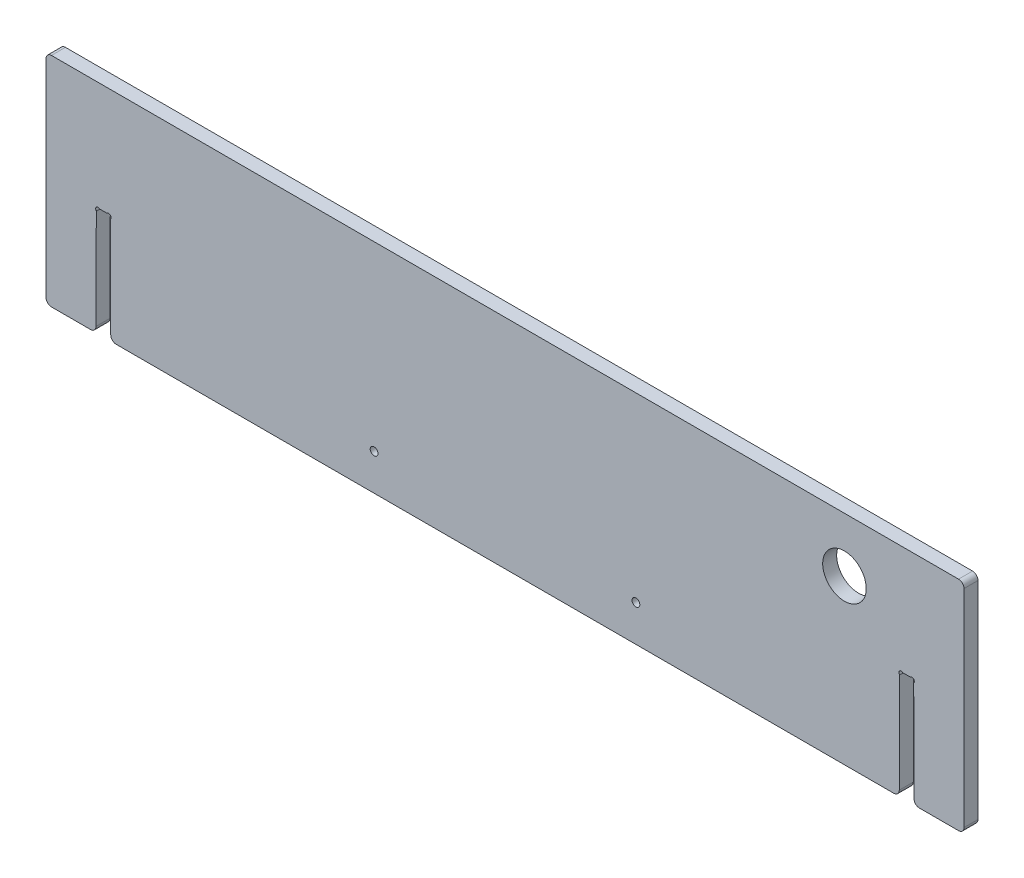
ISO-10303-21;
HEADER;
FILE_DESCRIPTION(('STEP AP214'),'2;1');
FILE_NAME('part.step','',(''),(''),'','','');
FILE_SCHEMA(('AUTOMOTIVE_DESIGN { 1 0 10303 214 1 1 1 1 }'));
ENDSEC;
DATA;
#1=APPLICATION_CONTEXT('core data for automotive mechanical design processes');
#2=APPLICATION_PROTOCOL_DEFINITION('international standard','automotive_design',2000,#1);
#3=PRODUCT_CONTEXT('',#1,'mechanical');
#4=PRODUCT('Part','Part','',(#3));
#5=PRODUCT_RELATED_PRODUCT_CATEGORY('part','',(#4));
#6=PRODUCT_DEFINITION_FORMATION('','',#4);
#7=PRODUCT_DEFINITION_CONTEXT('part definition',#1,'design');
#8=PRODUCT_DEFINITION('design','',#6,#7);
#9=PRODUCT_DEFINITION_SHAPE('','',#8);
#10=(LENGTH_UNIT() NAMED_UNIT(*) SI_UNIT(.MILLI.,.METRE.));
#11=(NAMED_UNIT(*) PLANE_ANGLE_UNIT() SI_UNIT($,.RADIAN.));
#12=(NAMED_UNIT(*) SI_UNIT($,.STERADIAN.) SOLID_ANGLE_UNIT());
#13=UNCERTAINTY_MEASURE_WITH_UNIT(LENGTH_MEASURE(1.E-05),#10,'distance_accuracy_value','');
#14=(GEOMETRIC_REPRESENTATION_CONTEXT(3) GLOBAL_UNCERTAINTY_ASSIGNED_CONTEXT((#13)) GLOBAL_UNIT_ASSIGNED_CONTEXT((#10,
#11,#12)) REPRESENTATION_CONTEXT('',''));
#15=CARTESIAN_POINT('',(0.,0.,0.));
#16=DIRECTION('',(0.,0.,1.));
#17=DIRECTION('',(1.,0.,0.));
#18=AXIS2_PLACEMENT_3D('',#15,#16,#17);
#19=CARTESIAN_POINT('',(0.,0.,18.));
#20=DIRECTION('',(0.,1.,0.));
#21=DIRECTION('',(0.,0.,1.));
#22=AXIS2_PLACEMENT_3D('',#19,#20,#21);
#23=PLANE('',#22);
#24=DIRECTION('',(1.,0.,0.));
#25=VECTOR('',#24,1.);
#26=CARTESIAN_POINT('',(0.,0.,0.));
#27=LINE('',#26,#25);
#28=CARTESIAN_POINT('',(7.,0.,0.));
#29=VERTEX_POINT('',#28);
#30=CARTESIAN_POINT('',(57.3324536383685,0.,0.));
#31=VERTEX_POINT('',#30);
#32=EDGE_CURVE('E466',#29,#31,#27,.T.);
#33=ORIENTED_EDGE('',*,*,#32,.T.);
#34=DIRECTION('',(0.,0.,1.));
#35=VECTOR('',#34,1.);
#36=CARTESIAN_POINT('',(57.3324536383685,0.,18.));
#37=LINE('',#36,#35);
#38=CARTESIAN_POINT('',(57.3324536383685,0.,18.));
#39=VERTEX_POINT('',#38);
#40=EDGE_CURVE('E491',#31,#39,#37,.T.);
#41=ORIENTED_EDGE('',*,*,#40,.T.);
#42=DIRECTION('',(1.,0.,0.));
#43=VECTOR('',#42,1.);
#44=CARTESIAN_POINT('',(0.,0.,18.));
#45=LINE('',#44,#43);
#46=CARTESIAN_POINT('',(7.,0.,18.));
#47=VERTEX_POINT('',#46);
#48=EDGE_CURVE('E459',#47,#39,#45,.T.);
#49=ORIENTED_EDGE('',*,*,#48,.F.);
#50=DIRECTION('',(0.,0.,-1.));
#51=VECTOR('',#50,1.);
#52=CARTESIAN_POINT('',(7.,0.,18.));
#53=LINE('',#52,#51);
#54=EDGE_CURVE('E488',#47,#29,#53,.T.);
#55=ORIENTED_EDGE('',*,*,#54,.T.);
#56=EDGE_LOOP('',(#33,#41,#49,#55));
#57=FACE_BOUND('',#56,.T.);
#58=ADVANCED_FACE('F33',(#57),#23,.F.);
#59=CARTESIAN_POINT('',(0.,0.,18.));
#60=DIRECTION('',(1.,0.,0.));
#61=DIRECTION('',(0.,0.,-1.));
#62=AXIS2_PLACEMENT_3D('',#59,#60,#61);
#63=PLANE('',#62);
#64=DIRECTION('',(0.,-1.,0.));
#65=VECTOR('',#64,1.);
#66=CARTESIAN_POINT('',(0.,0.,0.));
#67=LINE('',#66,#65);
#68=CARTESIAN_POINT('',(0.,273.25,0.));
#69=VERTEX_POINT('',#68);
#70=CARTESIAN_POINT('',(0.,7.,0.));
#71=VERTEX_POINT('',#70);
#72=EDGE_CURVE('E438',#69,#71,#67,.T.);
#73=ORIENTED_EDGE('',*,*,#72,.T.);
#74=DIRECTION('',(0.,0.,-1.));
#75=VECTOR('',#74,1.);
#76=CARTESIAN_POINT('',(0.,7.,18.));
#77=LINE('',#76,#75);
#78=CARTESIAN_POINT('',(0.,7.,18.));
#79=VERTEX_POINT('',#78);
#80=EDGE_CURVE('E41',#71,#79,#77,.F.);
#81=ORIENTED_EDGE('',*,*,#80,.T.);
#82=DIRECTION('',(0.,-1.,0.));
#83=VECTOR('',#82,1.);
#84=CARTESIAN_POINT('',(0.,0.,18.));
#85=LINE('',#84,#83);
#86=CARTESIAN_POINT('',(0.,273.25,18.));
#87=VERTEX_POINT('',#86);
#88=EDGE_CURVE('E453',#87,#79,#85,.T.);
#89=ORIENTED_EDGE('',*,*,#88,.F.);
#90=DIRECTION('',(0.,0.,-1.));
#91=VECTOR('',#90,1.);
#92=CARTESIAN_POINT('',(0.,273.25,18.));
#93=LINE('',#92,#91);
#94=EDGE_CURVE('E496',#87,#69,#93,.T.);
#95=ORIENTED_EDGE('',*,*,#94,.T.);
#96=EDGE_LOOP('',(#73,#81,#89,#95));
#97=FACE_BOUND('',#96,.T.);
#98=ADVANCED_FACE('F501',(#97),#63,.F.);
#99=CARTESIAN_POINT('',(90.2925463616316,0.,18.));
#100=VERTEX_POINT('',#99);
#101=CARTESIAN_POINT('',(1090.70745363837,0.,18.));
#102=VERTEX_POINT('',#101);
#103=EDGE_CURVE('E456',#100,#102,#45,.T.);
#104=ORIENTED_EDGE('',*,*,#103,.F.);
#105=DIRECTION('',(0.,0.,1.));
#106=VECTOR('',#105,1.);
#107=CARTESIAN_POINT('',(90.2925463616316,0.,18.));
#108=LINE('',#107,#106);
#109=CARTESIAN_POINT('',(90.2925463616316,0.,0.));
#110=VERTEX_POINT('',#109);
#111=EDGE_CURVE('E480',#100,#110,#108,.F.);
#112=ORIENTED_EDGE('',*,*,#111,.T.);
#113=CARTESIAN_POINT('',(1090.70745363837,0.,0.));
#114=VERTEX_POINT('',#113);
#115=EDGE_CURVE('E465',#110,#114,#27,.T.);
#116=ORIENTED_EDGE('',*,*,#115,.T.);
#117=DIRECTION('',(0.,0.,1.));
#118=VECTOR('',#117,1.);
#119=CARTESIAN_POINT('',(1090.70745363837,0.,18.));
#120=LINE('',#119,#118);
#121=EDGE_CURVE('E347',#102,#114,#120,.F.);
#122=ORIENTED_EDGE('',*,*,#121,.F.);
#123=EDGE_LOOP('',(#104,#112,#116,#122));
#124=FACE_BOUND('',#123,.T.);
#125=ADVANCED_FACE('F563',(#124),#23,.F.);
#126=CARTESIAN_POINT('',(0.,280.25,18.));
#127=DIRECTION('',(0.,-1.,0.));
#128=DIRECTION('',(0.,0.,-1.));
#129=AXIS2_PLACEMENT_3D('',#126,#127,#128);
#130=PLANE('',#129);
#131=DIRECTION('',(-1.,0.,0.));
#132=VECTOR('',#131,1.);
#133=CARTESIAN_POINT('',(0.,280.25,0.));
#134=LINE('',#133,#132);
#135=CARTESIAN_POINT('',(1174.,280.25,0.));
#136=VERTEX_POINT('',#135);
#137=CARTESIAN_POINT('',(7.,280.25,0.));
#138=VERTEX_POINT('',#137);
#139=EDGE_CURVE('E457',#136,#138,#134,.T.);
#140=ORIENTED_EDGE('',*,*,#139,.T.);
#141=DIRECTION('',(0.,0.,-1.));
#142=VECTOR('',#141,1.);
#143=CARTESIAN_POINT('',(7.,280.25,18.));
#144=LINE('',#143,#142);
#145=CARTESIAN_POINT('',(7.,280.25,18.));
#146=VERTEX_POINT('',#145);
#147=EDGE_CURVE('E11',#138,#146,#144,.F.);
#148=ORIENTED_EDGE('',*,*,#147,.T.);
#149=DIRECTION('',(-1.,0.,0.));
#150=VECTOR('',#149,1.);
#151=CARTESIAN_POINT('',(0.,280.25,18.));
#152=LINE('',#151,#150);
#153=CARTESIAN_POINT('',(1174.,280.25,18.));
#154=VERTEX_POINT('',#153);
#155=EDGE_CURVE('E460',#154,#146,#152,.T.);
#156=ORIENTED_EDGE('',*,*,#155,.F.);
#157=DIRECTION('',(0.,0.,-1.));
#158=VECTOR('',#157,1.);
#159=CARTESIAN_POINT('',(1174.,280.25,18.));
#160=LINE('',#159,#158);
#161=EDGE_CURVE('E374',#136,#154,#160,.F.);
#162=ORIENTED_EDGE('',*,*,#161,.F.);
#163=EDGE_LOOP('',(#140,#148,#156,#162));
#164=FACE_BOUND('',#163,.T.);
#165=ADVANCED_FACE('F616',(#164),#130,.F.);
#166=CARTESIAN_POINT('',(0.,0.,18.));
#167=DIRECTION('',(0.,0.,-1.));
#168=DIRECTION('',(-1.,0.,0.));
#169=AXIS2_PLACEMENT_3D('',#166,#167,#168);
#170=PLANE('',#169);
#171=CARTESIAN_POINT('',(1027.1875,210.25,18.));
#172=DIRECTION('',(0.,0.,1.));
#173=DIRECTION('',(1.,0.,0.));
#174=AXIS2_PLACEMENT_3D('',#171,#172,#173);
#175=CIRCLE('',#174,28.);
#176=CARTESIAN_POINT('',(1055.1875,210.25,18.));
#177=VERTEX_POINT('',#176);
#178=EDGE_CURVE('E710',#177,#177,#175,.T.);
#179=ORIENTED_EDGE('',*,*,#178,.F.);
#180=EDGE_LOOP('',(#179));
#181=FACE_BOUND('',#180,.T.);
#182=CARTESIAN_POINT('',(422.0625,46.7083333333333,18.));
#183=DIRECTION('',(0.,0.,1.));
#184=DIRECTION('',(1.,0.,0.));
#185=AXIS2_PLACEMENT_3D('',#182,#183,#184);
#186=CIRCLE('',#185,4.99999999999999);
#187=CARTESIAN_POINT('',(427.0625,46.7083333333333,18.));
#188=VERTEX_POINT('',#187);
#189=EDGE_CURVE('E377',#188,#188,#186,.T.);
#190=ORIENTED_EDGE('',*,*,#189,.F.);
#191=EDGE_LOOP('',(#190));
#192=FACE_BOUND('',#191,.T.);
#193=DIRECTION('',(-0.00285458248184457,0.999995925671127,0.));
#194=VECTOR('',#193,1.);
#195=CARTESIAN_POINT('',(82.9260624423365,135.373906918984,18.));
#196=LINE('',#195,#194);
#197=CARTESIAN_POINT('',(83.2925748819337,6.98001792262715,18.));
#198=VERTEX_POINT('',#197);
#199=CARTESIAN_POINT('',(82.9260624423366,135.373906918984,18.));
#200=VERTEX_POINT('',#199);
#201=EDGE_CURVE('E381',#198,#200,#196,.T.);
#202=ORIENTED_EDGE('',*,*,#201,.F.);
#203=CARTESIAN_POINT('',(90.2925463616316,7.00000000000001,18.));
#204=DIRECTION('',(0.,0.,-1.));
#205=DIRECTION('',(-1.,0.,0.));
#206=AXIS2_PLACEMENT_3D('',#203,#204,#205);
#207=CIRCLE('',#206,7.);
#208=EDGE_CURVE('E478',#198,#100,#207,.F.);
#209=ORIENTED_EDGE('',*,*,#208,.T.);
#210=ORIENTED_EDGE('',*,*,#103,.T.);
#211=CARTESIAN_POINT('',(1090.70745363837,7.00000000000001,18.));
#212=DIRECTION('',(0.,0.,1.));
#213=DIRECTION('',(1.,0.,0.));
#214=AXIS2_PLACEMENT_3D('',#211,#212,#213);
#215=CIRCLE('',#214,7.);
#216=CARTESIAN_POINT('',(1097.70742511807,6.98001792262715,18.));
#217=VERTEX_POINT('',#216);
#218=EDGE_CURVE('E344',#217,#102,#215,.F.);
#219=ORIENTED_EDGE('',*,*,#218,.F.);
#220=DIRECTION('',(0.00285458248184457,0.999995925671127,0.));
#221=VECTOR('',#220,1.);
#222=CARTESIAN_POINT('',(1098.07393755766,135.373906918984,18.));
#223=LINE('',#222,#221);
#224=CARTESIAN_POINT('',(1098.07393755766,135.373906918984,18.));
#225=VERTEX_POINT('',#224);
#226=EDGE_CURVE('E286',#217,#225,#223,.T.);
#227=ORIENTED_EDGE('',*,*,#226,.T.);
#228=CARTESIAN_POINT('',(1097.07394163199,135.376761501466,18.));
#229=DIRECTION('',(0.,0.,1.));
#230=DIRECTION('',(-1.,0.,0.));
#231=AXIS2_PLACEMENT_3D('',#228,#229,#230);
#232=CIRCLE('',#231,1.00000000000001);
#233=CARTESIAN_POINT('',(1097.85579270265,136.000226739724,18.));
#234=VERTEX_POINT('',#233);
#235=EDGE_CURVE('E289',#225,#234,#232,.T.);
#236=ORIENTED_EDGE('',*,*,#235,.T.);
#237=CARTESIAN_POINT('',(1100.27953102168,137.932968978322,18.));
#238=DIRECTION('',(0.,0.,-1.));
#239=DIRECTION('',(1.,0.,0.));
#240=AXIS2_PLACEMENT_3D('',#237,#238,#239);
#241=CIRCLE('',#240,3.09999999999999);
#242=CARTESIAN_POINT('',(1102.22505951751,140.346455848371,18.));
#243=VERTEX_POINT('',#242);
#244=EDGE_CURVE('E247',#234,#243,#241,.T.);
#245=ORIENTED_EDGE('',*,*,#244,.T.);
#246=CARTESIAN_POINT('',(1102.85264935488,141.125,18.));
#247=DIRECTION('',(0.,0.,1.));
#248=DIRECTION('',(1.,0.,0.));
#249=AXIS2_PLACEMENT_3D('',#246,#247,#248);
#250=CIRCLE('',#249,1.00000000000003);
#251=CARTESIAN_POINT('',(1102.85264935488,140.125,18.));
#252=VERTEX_POINT('',#251);
#253=EDGE_CURVE('E293',#243,#252,#250,.T.);
#254=ORIENTED_EDGE('',*,*,#253,.T.);
#255=DIRECTION('',(1.,0.,0.));
#256=VECTOR('',#255,1.);
#257=CARTESIAN_POINT('',(1111.52235064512,140.125,18.));
#258=LINE('',#257,#256);
#259=CARTESIAN_POINT('',(1111.52235064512,140.125,18.));
#260=VERTEX_POINT('',#259);
#261=EDGE_CURVE('E296',#252,#260,#258,.T.);
#262=ORIENTED_EDGE('',*,*,#261,.T.);
#263=CARTESIAN_POINT('',(1111.52235064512,141.125,18.));
#264=DIRECTION('',(0.,0.,1.));
#265=DIRECTION('',(-1.,0.,0.));
#266=AXIS2_PLACEMENT_3D('',#263,#264,#265);
#267=CIRCLE('',#266,1.00000000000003);
#268=CARTESIAN_POINT('',(1112.14994048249,140.346455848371,18.));
#269=VERTEX_POINT('',#268);
#270=EDGE_CURVE('E299',#260,#269,#267,.T.);
#271=ORIENTED_EDGE('',*,*,#270,.T.);
#272=CARTESIAN_POINT('',(1114.09546897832,137.932968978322,18.));
#273=DIRECTION('',(0.,0.,-1.));
#274=DIRECTION('',(-1.,0.,0.));
#275=AXIS2_PLACEMENT_3D('',#272,#273,#274);
#276=CIRCLE('',#275,3.09999999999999);
#277=CARTESIAN_POINT('',(1116.51920729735,136.000226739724,18.));
#278=VERTEX_POINT('',#277);
#279=EDGE_CURVE('E302',#269,#278,#276,.T.);
#280=ORIENTED_EDGE('',*,*,#279,.T.);
#281=CARTESIAN_POINT('',(1117.30105836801,135.376761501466,18.));
#282=DIRECTION('',(0.,0.,1.));
#283=DIRECTION('',(1.,0.,0.));
#284=AXIS2_PLACEMENT_3D('',#281,#282,#283);
#285=CIRCLE('',#284,1.00000000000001);
#286=CARTESIAN_POINT('',(1116.30106244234,135.373906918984,18.));
#287=VERTEX_POINT('',#286);
#288=EDGE_CURVE('E305',#278,#287,#285,.T.);
#289=ORIENTED_EDGE('',*,*,#288,.T.);
#290=DIRECTION('',(0.00285458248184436,-0.999995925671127,0.));
#291=VECTOR('',#290,1.);
#292=CARTESIAN_POINT('',(1116.30106244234,135.373906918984,18.));
#293=LINE('',#292,#291);
#294=CARTESIAN_POINT('',(1116.66757488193,6.98001792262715,18.));
#295=VERTEX_POINT('',#294);
#296=EDGE_CURVE('E308',#287,#295,#293,.T.);
#297=ORIENTED_EDGE('',*,*,#296,.T.);
#298=CARTESIAN_POINT('',(1123.66754636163,7.,18.));
#299=DIRECTION('',(0.,0.,1.));
#300=DIRECTION('',(1.,0.,0.));
#301=AXIS2_PLACEMENT_3D('',#298,#299,#300);
#302=CIRCLE('',#301,7.);
#303=CARTESIAN_POINT('',(1123.66754636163,0.,18.));
#304=VERTEX_POINT('',#303);
#305=EDGE_CURVE('E341',#304,#295,#302,.F.);
#306=ORIENTED_EDGE('',*,*,#305,.F.);
#307=DIRECTION('',(-1.,0.,0.));
#308=VECTOR('',#307,1.);
#309=CARTESIAN_POINT('',(1181.,0.,18.));
#310=LINE('',#309,#308);
#311=CARTESIAN_POINT('',(1174.,0.,18.));
#312=VERTEX_POINT('',#311);
#313=EDGE_CURVE('E327',#312,#304,#310,.T.);
#314=ORIENTED_EDGE('',*,*,#313,.F.);
#315=CARTESIAN_POINT('',(1174.,7.,18.));
#316=DIRECTION('',(0.,0.,1.));
#317=DIRECTION('',(1.,0.,0.));
#318=AXIS2_PLACEMENT_3D('',#315,#316,#317);
#319=CIRCLE('',#318,7.);
#320=CARTESIAN_POINT('',(1181.,7.,18.));
#321=VERTEX_POINT('',#320);
#322=EDGE_CURVE('E339',#321,#312,#319,.F.);
#323=ORIENTED_EDGE('',*,*,#322,.F.);
#324=DIRECTION('',(0.,-1.,0.));
#325=VECTOR('',#324,1.);
#326=CARTESIAN_POINT('',(1181.,0.,18.));
#327=LINE('',#326,#325);
#328=CARTESIAN_POINT('',(1181.,273.25,18.));
#329=VERTEX_POINT('',#328);
#330=EDGE_CURVE('E324',#329,#321,#327,.T.);
#331=ORIENTED_EDGE('',*,*,#330,.F.);
#332=CARTESIAN_POINT('',(1174.,273.25,18.));
#333=DIRECTION('',(0.,0.,1.));
#334=DIRECTION('',(1.,0.,0.));
#335=AXIS2_PLACEMENT_3D('',#332,#333,#334);
#336=CIRCLE('',#335,7.);
#337=EDGE_CURVE('E337',#154,#329,#336,.F.);
#338=ORIENTED_EDGE('',*,*,#337,.F.);
#339=ORIENTED_EDGE('',*,*,#155,.T.);
#340=CARTESIAN_POINT('',(7.,273.25,18.));
#341=DIRECTION('',(0.,0.,-1.));
#342=DIRECTION('',(-1.,0.,0.));
#343=AXIS2_PLACEMENT_3D('',#340,#341,#342);
#344=CIRCLE('',#343,7.);
#345=EDGE_CURVE('E472',#146,#87,#344,.F.);
#346=ORIENTED_EDGE('',*,*,#345,.T.);
#347=ORIENTED_EDGE('',*,*,#88,.T.);
#348=CARTESIAN_POINT('',(7.,7.,18.));
#349=DIRECTION('',(0.,0.,-1.));
#350=DIRECTION('',(-1.,0.,0.));
#351=AXIS2_PLACEMENT_3D('',#348,#349,#350);
#352=CIRCLE('',#351,7.);
#353=EDGE_CURVE('E474',#79,#47,#352,.F.);
#354=ORIENTED_EDGE('',*,*,#353,.T.);
#355=ORIENTED_EDGE('',*,*,#48,.T.);
#356=CARTESIAN_POINT('',(57.3324536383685,7.,18.));
#357=DIRECTION('',(0.,0.,-1.));
#358=DIRECTION('',(-1.,0.,0.));
#359=AXIS2_PLACEMENT_3D('',#356,#357,#358);
#360=CIRCLE('',#359,7.);
#361=CARTESIAN_POINT('',(64.3324251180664,6.98001792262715,18.));
#362=VERTEX_POINT('',#361);
#363=EDGE_CURVE('E476',#39,#362,#360,.F.);
#364=ORIENTED_EDGE('',*,*,#363,.T.);
#365=DIRECTION('',(-0.00285458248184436,-0.999995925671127,0.));
#366=VECTOR('',#365,1.);
#367=CARTESIAN_POINT('',(64.6989375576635,135.373906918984,18.));
#368=LINE('',#367,#366);
#369=CARTESIAN_POINT('',(64.6989375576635,135.373906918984,18.));
#370=VERTEX_POINT('',#369);
#371=EDGE_CURVE('E387',#370,#362,#368,.T.);
#372=ORIENTED_EDGE('',*,*,#371,.F.);
#373=CARTESIAN_POINT('',(63.6989416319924,135.376761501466,18.));
#374=DIRECTION('',(0.,0.,-1.));
#375=DIRECTION('',(-1.,0.,0.));
#376=AXIS2_PLACEMENT_3D('',#373,#374,#375);
#377=CIRCLE('',#376,1.00000000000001);
#378=CARTESIAN_POINT('',(64.4807927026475,136.000226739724,18.));
#379=VERTEX_POINT('',#378);
#380=EDGE_CURVE('E431',#379,#370,#377,.T.);
#381=ORIENTED_EDGE('',*,*,#380,.F.);
#382=CARTESIAN_POINT('',(66.9045310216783,137.932968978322,18.));
#383=DIRECTION('',(0.,0.,1.));
#384=DIRECTION('',(1.,0.,0.));
#385=AXIS2_PLACEMENT_3D('',#382,#383,#384);
#386=CIRCLE('',#385,3.09999999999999);
#387=CARTESIAN_POINT('',(68.8500595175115,140.346455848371,18.));
#388=VERTEX_POINT('',#387);
#389=EDGE_CURVE('E428',#388,#379,#386,.T.);
#390=ORIENTED_EDGE('',*,*,#389,.F.);
#391=CARTESIAN_POINT('',(69.477649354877,141.125,18.));
#392=DIRECTION('',(0.,0.,-1.));
#393=DIRECTION('',(1.,0.,0.));
#394=AXIS2_PLACEMENT_3D('',#391,#392,#393);
#395=CIRCLE('',#394,1.00000000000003);
#396=CARTESIAN_POINT('',(69.477649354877,140.125,18.));
#397=VERTEX_POINT('',#396);
#398=EDGE_CURVE('E425',#397,#388,#395,.T.);
#399=ORIENTED_EDGE('',*,*,#398,.F.);
#400=DIRECTION('',(-1.,0.,0.));
#401=VECTOR('',#400,1.);
#402=CARTESIAN_POINT('',(69.477649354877,140.125,18.));
#403=LINE('',#402,#401);
#404=CARTESIAN_POINT('',(78.1473506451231,140.125,18.));
#405=VERTEX_POINT('',#404);
#406=EDGE_CURVE('E422',#405,#397,#403,.T.);
#407=ORIENTED_EDGE('',*,*,#406,.F.);
#408=CARTESIAN_POINT('',(78.1473506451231,141.125,18.));
#409=DIRECTION('',(0.,0.,-1.));
#410=DIRECTION('',(-1.,0.,0.));
#411=AXIS2_PLACEMENT_3D('',#408,#409,#410);
#412=CIRCLE('',#411,1.00000000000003);
#413=CARTESIAN_POINT('',(78.7749404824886,140.346455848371,18.));
#414=VERTEX_POINT('',#413);
#415=EDGE_CURVE('E419',#414,#405,#412,.T.);
#416=ORIENTED_EDGE('',*,*,#415,.F.);
#417=CARTESIAN_POINT('',(80.7204689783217,137.932968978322,18.));
#418=DIRECTION('',(0.,0.,1.));
#419=DIRECTION('',(-1.,0.,0.));
#420=AXIS2_PLACEMENT_3D('',#417,#418,#419);
#421=CIRCLE('',#420,3.09999999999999);
#422=CARTESIAN_POINT('',(83.1442072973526,136.000226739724,18.));
#423=VERTEX_POINT('',#422);
#424=EDGE_CURVE('E416',#423,#414,#421,.T.);
#425=ORIENTED_EDGE('',*,*,#424,.F.);
#426=CARTESIAN_POINT('',(83.9260583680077,135.376761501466,18.));
#427=DIRECTION('',(0.,0.,-1.));
#428=DIRECTION('',(1.,0.,0.));
#429=AXIS2_PLACEMENT_3D('',#426,#427,#428);
#430=CIRCLE('',#429,1.00000000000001);
#431=EDGE_CURVE('E413',#200,#423,#430,.T.);
#432=ORIENTED_EDGE('',*,*,#431,.F.);
#433=EDGE_LOOP('',(#202,#209,#210,#219,#227,#236,#245,#254,#262,#271,#280,#289,#297,#306,#314,
#323,#331,#338,#339,#346,#347,#354,#355,#364,#372,#381,#390,#399,#407,#416,#425,#432));
#434=FACE_BOUND('',#433,.T.);
#435=CARTESIAN_POINT('',(758.9375,46.7083333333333,18.));
#436=DIRECTION('',(0.,0.,-1.));
#437=DIRECTION('',(-1.,0.,0.));
#438=AXIS2_PLACEMENT_3D('',#435,#436,#437);
#439=CIRCLE('',#438,4.99999999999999);
#440=CARTESIAN_POINT('',(753.9375,46.7083333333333,18.));
#441=VERTEX_POINT('',#440);
#442=EDGE_CURVE('E712',#441,#441,#439,.T.);
#443=ORIENTED_EDGE('',*,*,#442,.T.);
#444=EDGE_LOOP('',(#443));
#445=FACE_BOUND('',#444,.T.);
#446=ADVANCED_FACE('F507',(#181,#192,#434,#445),#170,.F.);
#447=CARTESIAN_POINT('',(0.,0.,0.));
#448=DIRECTION('',(0.,0.,-1.));
#449=DIRECTION('',(-1.,0.,0.));
#450=AXIS2_PLACEMENT_3D('',#447,#448,#449);
#451=PLANE('',#450);
#452=CARTESIAN_POINT('',(1027.1875,210.25,0.));
#453=DIRECTION('',(0.,0.,1.));
#454=DIRECTION('',(1.,0.,0.));
#455=AXIS2_PLACEMENT_3D('',#452,#453,#454);
#456=CIRCLE('',#455,28.);
#457=CARTESIAN_POINT('',(1055.1875,210.25,0.));
#458=VERTEX_POINT('',#457);
#459=EDGE_CURVE('E707',#458,#458,#456,.T.);
#460=ORIENTED_EDGE('',*,*,#459,.T.);
#461=EDGE_LOOP('',(#460));
#462=FACE_BOUND('',#461,.T.);
#463=CARTESIAN_POINT('',(422.0625,46.7083333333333,0.));
#464=DIRECTION('',(0.,0.,1.));
#465=DIRECTION('',(1.,0.,0.));
#466=AXIS2_PLACEMENT_3D('',#463,#464,#465);
#467=CIRCLE('',#466,4.99999999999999);
#468=CARTESIAN_POINT('',(427.0625,46.7083333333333,0.));
#469=VERTEX_POINT('',#468);
#470=EDGE_CURVE('E378',#469,#469,#467,.T.);
#471=ORIENTED_EDGE('',*,*,#470,.T.);
#472=EDGE_LOOP('',(#471));
#473=FACE_BOUND('',#472,.T.);
#474=ORIENTED_EDGE('',*,*,#115,.F.);
#475=CARTESIAN_POINT('',(90.2925463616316,7.00000000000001,0.));
#476=DIRECTION('',(0.,0.,-1.));
#477=DIRECTION('',(-1.,0.,0.));
#478=AXIS2_PLACEMENT_3D('',#475,#476,#477);
#479=CIRCLE('',#478,7.);
#480=CARTESIAN_POINT('',(83.2925748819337,6.98001792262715,0.));
#481=VERTEX_POINT('',#480);
#482=EDGE_CURVE('E486',#110,#481,#479,.T.);
#483=ORIENTED_EDGE('',*,*,#482,.T.);
#484=DIRECTION('',(-0.00285458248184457,0.999995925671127,0.));
#485=VECTOR('',#484,1.);
#486=CARTESIAN_POINT('',(82.9260624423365,135.373906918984,0.));
#487=LINE('',#486,#485);
#488=CARTESIAN_POINT('',(82.9260624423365,135.373906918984,0.));
#489=VERTEX_POINT('',#488);
#490=EDGE_CURVE('E384',#481,#489,#487,.T.);
#491=ORIENTED_EDGE('',*,*,#490,.T.);
#492=CARTESIAN_POINT('',(83.9260583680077,135.376761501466,0.));
#493=DIRECTION('',(0.,0.,-1.));
#494=DIRECTION('',(1.,0.,0.));
#495=AXIS2_PLACEMENT_3D('',#492,#493,#494);
#496=CIRCLE('',#495,1.00000000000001);
#497=CARTESIAN_POINT('',(83.1442072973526,136.000226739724,0.));
#498=VERTEX_POINT('',#497);
#499=EDGE_CURVE('E386',#489,#498,#496,.T.);
#500=ORIENTED_EDGE('',*,*,#499,.T.);
#501=CARTESIAN_POINT('',(80.7204689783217,137.932968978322,0.));
#502=DIRECTION('',(0.,0.,1.));
#503=DIRECTION('',(-1.,0.,0.));
#504=AXIS2_PLACEMENT_3D('',#501,#502,#503);
#505=CIRCLE('',#504,3.09999999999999);
#506=CARTESIAN_POINT('',(78.7749404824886,140.346455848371,0.));
#507=VERTEX_POINT('',#506);
#508=EDGE_CURVE('E390',#498,#507,#505,.T.);
#509=ORIENTED_EDGE('',*,*,#508,.T.);
#510=CARTESIAN_POINT('',(78.1473506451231,141.125,0.));
#511=DIRECTION('',(0.,0.,-1.));
#512=DIRECTION('',(-1.,0.,0.));
#513=AXIS2_PLACEMENT_3D('',#510,#511,#512);
#514=CIRCLE('',#513,1.00000000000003);
#515=CARTESIAN_POINT('',(78.1473506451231,140.125,0.));
#516=VERTEX_POINT('',#515);
#517=EDGE_CURVE('E393',#507,#516,#514,.T.);
#518=ORIENTED_EDGE('',*,*,#517,.T.);
#519=DIRECTION('',(-1.,0.,0.));
#520=VECTOR('',#519,1.);
#521=CARTESIAN_POINT('',(69.477649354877,140.125,0.));
#522=LINE('',#521,#520);
#523=CARTESIAN_POINT('',(69.477649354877,140.125,0.));
#524=VERTEX_POINT('',#523);
#525=EDGE_CURVE('E396',#516,#524,#522,.T.);
#526=ORIENTED_EDGE('',*,*,#525,.T.);
#527=CARTESIAN_POINT('',(69.477649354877,141.125,0.));
#528=DIRECTION('',(0.,0.,-1.));
#529=DIRECTION('',(1.,0.,0.));
#530=AXIS2_PLACEMENT_3D('',#527,#528,#529);
#531=CIRCLE('',#530,1.00000000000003);
#532=CARTESIAN_POINT('',(68.8500595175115,140.346455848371,0.));
#533=VERTEX_POINT('',#532);
#534=EDGE_CURVE('E399',#524,#533,#531,.T.);
#535=ORIENTED_EDGE('',*,*,#534,.T.);
#536=CARTESIAN_POINT('',(66.9045310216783,137.932968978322,0.));
#537=DIRECTION('',(0.,0.,1.));
#538=DIRECTION('',(1.,0.,0.));
#539=AXIS2_PLACEMENT_3D('',#536,#537,#538);
#540=CIRCLE('',#539,3.09999999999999);
#541=CARTESIAN_POINT('',(64.4807927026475,136.000226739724,0.));
#542=VERTEX_POINT('',#541);
#543=EDGE_CURVE('E402',#533,#542,#540,.T.);
#544=ORIENTED_EDGE('',*,*,#543,.T.);
#545=CARTESIAN_POINT('',(63.6989416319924,135.376761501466,0.));
#546=DIRECTION('',(0.,0.,-1.));
#547=DIRECTION('',(-1.,0.,0.));
#548=AXIS2_PLACEMENT_3D('',#545,#546,#547);
#549=CIRCLE('',#548,1.00000000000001);
#550=CARTESIAN_POINT('',(64.6989375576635,135.373906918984,0.));
#551=VERTEX_POINT('',#550);
#552=EDGE_CURVE('E405',#542,#551,#549,.T.);
#553=ORIENTED_EDGE('',*,*,#552,.T.);
#554=DIRECTION('',(-0.00285458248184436,-0.999995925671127,0.));
#555=VECTOR('',#554,1.);
#556=CARTESIAN_POINT('',(64.6989375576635,135.373906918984,0.));
#557=LINE('',#556,#555);
#558=CARTESIAN_POINT('',(64.3324251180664,6.98001792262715,0.));
#559=VERTEX_POINT('',#558);
#560=EDGE_CURVE('E408',#551,#559,#557,.T.);
#561=ORIENTED_EDGE('',*,*,#560,.T.);
#562=CARTESIAN_POINT('',(57.3324536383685,7.,0.));
#563=DIRECTION('',(0.,0.,-1.));
#564=DIRECTION('',(-1.,0.,0.));
#565=AXIS2_PLACEMENT_3D('',#562,#563,#564);
#566=CIRCLE('',#565,7.);
#567=EDGE_CURVE('E484',#559,#31,#566,.T.);
#568=ORIENTED_EDGE('',*,*,#567,.T.);
#569=ORIENTED_EDGE('',*,*,#32,.F.);
#570=CARTESIAN_POINT('',(7.,7.,0.));
#571=DIRECTION('',(0.,0.,-1.));
#572=DIRECTION('',(-1.,0.,0.));
#573=AXIS2_PLACEMENT_3D('',#570,#571,#572);
#574=CIRCLE('',#573,7.);
#575=EDGE_CURVE('E54',#29,#71,#574,.T.);
#576=ORIENTED_EDGE('',*,*,#575,.T.);
#577=ORIENTED_EDGE('',*,*,#72,.F.);
#578=CARTESIAN_POINT('',(7.,273.25,0.));
#579=DIRECTION('',(0.,0.,-1.));
#580=DIRECTION('',(-1.,0.,0.));
#581=AXIS2_PLACEMENT_3D('',#578,#579,#580);
#582=CIRCLE('',#581,7.);
#583=EDGE_CURVE('E48',#69,#138,#582,.T.);
#584=ORIENTED_EDGE('',*,*,#583,.T.);
#585=ORIENTED_EDGE('',*,*,#139,.F.);
#586=CARTESIAN_POINT('',(1174.,273.25,0.));
#587=DIRECTION('',(0.,0.,1.));
#588=DIRECTION('',(1.,0.,0.));
#589=AXIS2_PLACEMENT_3D('',#586,#587,#588);
#590=CIRCLE('',#589,7.);
#591=CARTESIAN_POINT('',(1181.,273.25,0.));
#592=VERTEX_POINT('',#591);
#593=EDGE_CURVE('E350',#592,#136,#590,.T.);
#594=ORIENTED_EDGE('',*,*,#593,.F.);
#595=DIRECTION('',(0.,-1.,0.));
#596=VECTOR('',#595,1.);
#597=CARTESIAN_POINT('',(1181.,0.,0.));
#598=LINE('',#597,#596);
#599=CARTESIAN_POINT('',(1181.,7.,0.));
#600=VERTEX_POINT('',#599);
#601=EDGE_CURVE('E313',#592,#600,#598,.T.);
#602=ORIENTED_EDGE('',*,*,#601,.T.);
#603=CARTESIAN_POINT('',(1174.,7.,0.));
#604=DIRECTION('',(0.,0.,1.));
#605=DIRECTION('',(1.,0.,0.));
#606=AXIS2_PLACEMENT_3D('',#603,#604,#605);
#607=CIRCLE('',#606,7.);
#608=CARTESIAN_POINT('',(1174.,0.,0.));
#609=VERTEX_POINT('',#608);
#610=EDGE_CURVE('E353',#609,#600,#607,.T.);
#611=ORIENTED_EDGE('',*,*,#610,.F.);
#612=DIRECTION('',(-1.,0.,0.));
#613=VECTOR('',#612,1.);
#614=CARTESIAN_POINT('',(1181.,0.,0.));
#615=LINE('',#614,#613);
#616=CARTESIAN_POINT('',(1123.66754636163,0.,0.));
#617=VERTEX_POINT('',#616);
#618=EDGE_CURVE('E328',#609,#617,#615,.T.);
#619=ORIENTED_EDGE('',*,*,#618,.T.);
#620=CARTESIAN_POINT('',(1123.66754636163,7.,0.));
#621=DIRECTION('',(0.,0.,1.));
#622=DIRECTION('',(1.,0.,0.));
#623=AXIS2_PLACEMENT_3D('',#620,#621,#622);
#624=CIRCLE('',#623,7.);
#625=CARTESIAN_POINT('',(1116.66757488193,6.98001792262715,0.));
#626=VERTEX_POINT('',#625);
#627=EDGE_CURVE('E355',#626,#617,#624,.T.);
#628=ORIENTED_EDGE('',*,*,#627,.F.);
#629=DIRECTION('',(0.00285458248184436,-0.999995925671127,0.));
#630=VECTOR('',#629,1.);
#631=CARTESIAN_POINT('',(1116.30106244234,135.373906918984,0.));
#632=LINE('',#631,#630);
#633=CARTESIAN_POINT('',(1116.30106244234,135.373906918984,0.));
#634=VERTEX_POINT('',#633);
#635=EDGE_CURVE('E283',#634,#626,#632,.T.);
#636=ORIENTED_EDGE('',*,*,#635,.F.);
#637=CARTESIAN_POINT('',(1117.30105836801,135.376761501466,0.));
#638=DIRECTION('',(0.,0.,1.));
#639=DIRECTION('',(1.,0.,0.));
#640=AXIS2_PLACEMENT_3D('',#637,#638,#639);
#641=CIRCLE('',#640,1.00000000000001);
#642=CARTESIAN_POINT('',(1116.51920729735,136.000226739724,0.));
#643=VERTEX_POINT('',#642);
#644=EDGE_CURVE('E280',#643,#634,#641,.T.);
#645=ORIENTED_EDGE('',*,*,#644,.F.);
#646=CARTESIAN_POINT('',(1114.09546897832,137.932968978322,0.));
#647=DIRECTION('',(0.,0.,-1.));
#648=DIRECTION('',(-1.,0.,0.));
#649=AXIS2_PLACEMENT_3D('',#646,#647,#648);
#650=CIRCLE('',#649,3.09999999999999);
#651=CARTESIAN_POINT('',(1112.14994048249,140.346455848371,0.));
#652=VERTEX_POINT('',#651);
#653=EDGE_CURVE('E277',#652,#643,#650,.T.);
#654=ORIENTED_EDGE('',*,*,#653,.F.);
#655=CARTESIAN_POINT('',(1111.52235064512,141.125,0.));
#656=DIRECTION('',(0.,0.,1.));
#657=DIRECTION('',(-1.,0.,0.));
#658=AXIS2_PLACEMENT_3D('',#655,#656,#657);
#659=CIRCLE('',#658,1.00000000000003);
#660=CARTESIAN_POINT('',(1111.52235064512,140.125,0.));
#661=VERTEX_POINT('',#660);
#662=EDGE_CURVE('E274',#661,#652,#659,.T.);
#663=ORIENTED_EDGE('',*,*,#662,.F.);
#664=DIRECTION('',(1.,0.,0.));
#665=VECTOR('',#664,1.);
#666=CARTESIAN_POINT('',(1111.52235064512,140.125,0.));
#667=LINE('',#666,#665);
#668=CARTESIAN_POINT('',(1102.85264935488,140.125,0.));
#669=VERTEX_POINT('',#668);
#670=EDGE_CURVE('E268',#669,#661,#667,.T.);
#671=ORIENTED_EDGE('',*,*,#670,.F.);
#672=CARTESIAN_POINT('',(1102.85264935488,141.125,0.));
#673=DIRECTION('',(0.,0.,1.));
#674=DIRECTION('',(1.,0.,0.));
#675=AXIS2_PLACEMENT_3D('',#672,#673,#674);
#676=CIRCLE('',#675,1.00000000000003);
#677=CARTESIAN_POINT('',(1102.22505951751,140.346455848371,0.));
#678=VERTEX_POINT('',#677);
#679=EDGE_CURVE('E266',#678,#669,#676,.T.);
#680=ORIENTED_EDGE('',*,*,#679,.F.);
#681=CARTESIAN_POINT('',(1100.27953102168,137.932968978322,0.));
#682=DIRECTION('',(0.,0.,-1.));
#683=DIRECTION('',(1.,0.,0.));
#684=AXIS2_PLACEMENT_3D('',#681,#682,#683);
#685=CIRCLE('',#684,3.09999999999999);
#686=CARTESIAN_POINT('',(1097.85579270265,136.000226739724,0.));
#687=VERTEX_POINT('',#686);
#688=EDGE_CURVE('E244',#687,#678,#685,.T.);
#689=ORIENTED_EDGE('',*,*,#688,.F.);
#690=CARTESIAN_POINT('',(1097.07394163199,135.376761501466,0.));
#691=DIRECTION('',(0.,0.,1.));
#692=DIRECTION('',(-1.,0.,0.));
#693=AXIS2_PLACEMENT_3D('',#690,#691,#692);
#694=CIRCLE('',#693,1.00000000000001);
#695=CARTESIAN_POINT('',(1098.07393755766,135.373906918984,0.));
#696=VERTEX_POINT('',#695);
#697=EDGE_CURVE('E255',#696,#687,#694,.T.);
#698=ORIENTED_EDGE('',*,*,#697,.F.);
#699=DIRECTION('',(0.00285458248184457,0.999995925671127,0.));
#700=VECTOR('',#699,1.);
#701=CARTESIAN_POINT('',(1098.07393755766,135.373906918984,0.));
#702=LINE('',#701,#700);
#703=CARTESIAN_POINT('',(1097.70742511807,6.98001792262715,0.));
#704=VERTEX_POINT('',#703);
#705=EDGE_CURVE('E259',#704,#696,#702,.T.);
#706=ORIENTED_EDGE('',*,*,#705,.F.);
#707=CARTESIAN_POINT('',(1090.70745363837,7.00000000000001,0.));
#708=DIRECTION('',(0.,0.,1.));
#709=DIRECTION('',(1.,0.,0.));
#710=AXIS2_PLACEMENT_3D('',#707,#708,#709);
#711=CIRCLE('',#710,7.);
#712=EDGE_CURVE('E357',#114,#704,#711,.T.);
#713=ORIENTED_EDGE('',*,*,#712,.F.);
#714=EDGE_LOOP('',(#474,#483,#491,#500,#509,#518,#526,#535,#544,#553,#561,#568,#569,#576,#577,
#584,#585,#594,#602,#611,#619,#628,#636,#645,#654,#663,#671,#680,#689,#698,#706,#713));
#715=FACE_BOUND('',#714,.T.);
#716=CARTESIAN_POINT('',(758.9375,46.7083333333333,0.));
#717=DIRECTION('',(0.,0.,-1.));
#718=DIRECTION('',(-1.,0.,0.));
#719=AXIS2_PLACEMENT_3D('',#716,#717,#718);
#720=CIRCLE('',#719,4.99999999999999);
#721=CARTESIAN_POINT('',(753.9375,46.7083333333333,0.));
#722=VERTEX_POINT('',#721);
#723=EDGE_CURVE('E290',#722,#722,#720,.T.);
#724=ORIENTED_EDGE('',*,*,#723,.F.);
#725=EDGE_LOOP('',(#724));
#726=FACE_BOUND('',#725,.T.);
#727=ADVANCED_FACE('F262',(#462,#473,#715,#726),#451,.T.);
#728=CARTESIAN_POINT('',(64.6989375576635,135.373906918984,0.));
#729=DIRECTION('',(-0.999995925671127,0.00285458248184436,0.));
#730=DIRECTION('',(-0.00285458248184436,-0.999995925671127,0.));
#731=AXIS2_PLACEMENT_3D('',#728,#729,#730);
#732=PLANE('',#731);
#733=ORIENTED_EDGE('',*,*,#371,.T.);
#734=DIRECTION('',(0.,0.,1.));
#735=VECTOR('',#734,1.);
#736=CARTESIAN_POINT('',(64.3324251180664,6.98001792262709,0.));
#737=LINE('',#736,#735);
#738=EDGE_CURVE('E494',#362,#559,#737,.F.);
#739=ORIENTED_EDGE('',*,*,#738,.T.);
#740=ORIENTED_EDGE('',*,*,#560,.F.);
#741=DIRECTION('',(0.,0.,1.));
#742=VECTOR('',#741,1.);
#743=CARTESIAN_POINT('',(64.6989375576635,135.373906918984,0.));
#744=LINE('',#743,#742);
#745=EDGE_CURVE('E436',#551,#370,#744,.T.);
#746=ORIENTED_EDGE('',*,*,#745,.T.);
#747=EDGE_LOOP('',(#733,#739,#740,#746));
#748=FACE_BOUND('',#747,.T.);
#749=ADVANCED_FACE('F524',(#748),#732,.F.);
#750=CARTESIAN_POINT('',(63.6989416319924,135.376761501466,0.));
#751=DIRECTION('',(0.,0.,1.));
#752=DIRECTION('',(1.,0.,0.));
#753=AXIS2_PLACEMENT_3D('',#750,#751,#752);
#754=CYLINDRICAL_SURFACE('',#753,1.00000000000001);
#755=ORIENTED_EDGE('',*,*,#380,.T.);
#756=ORIENTED_EDGE('',*,*,#745,.F.);
#757=ORIENTED_EDGE('',*,*,#552,.F.);
#758=DIRECTION('',(0.,0.,1.));
#759=VECTOR('',#758,1.);
#760=CARTESIAN_POINT('',(64.4807927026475,136.000226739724,0.));
#761=LINE('',#760,#759);
#762=EDGE_CURVE('E439',#542,#379,#761,.T.);
#763=ORIENTED_EDGE('',*,*,#762,.T.);
#764=EDGE_LOOP('',(#755,#756,#757,#763));
#765=FACE_BOUND('',#764,.T.);
#766=ADVANCED_FACE('F527',(#765),#754,.T.);
#767=CARTESIAN_POINT('',(66.9045310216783,137.932968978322,0.));
#768=DIRECTION('',(0.,0.,1.));
#769=DIRECTION('',(1.,0.,0.));
#770=AXIS2_PLACEMENT_3D('',#767,#768,#769);
#771=CYLINDRICAL_SURFACE('',#770,3.09999999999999);
#772=ORIENTED_EDGE('',*,*,#389,.T.);
#773=ORIENTED_EDGE('',*,*,#762,.F.);
#774=ORIENTED_EDGE('',*,*,#543,.F.);
#775=DIRECTION('',(0.,0.,1.));
#776=VECTOR('',#775,1.);
#777=CARTESIAN_POINT('',(68.8500595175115,140.346455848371,0.));
#778=LINE('',#777,#776);
#779=EDGE_CURVE('E441',#533,#388,#778,.T.);
#780=ORIENTED_EDGE('',*,*,#779,.T.);
#781=EDGE_LOOP('',(#772,#773,#774,#780));
#782=FACE_BOUND('',#781,.T.);
#783=ADVANCED_FACE('F532',(#782),#771,.F.);
#784=CARTESIAN_POINT('',(69.477649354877,141.125,0.));
#785=DIRECTION('',(0.,0.,1.));
#786=DIRECTION('',(1.,0.,0.));
#787=AXIS2_PLACEMENT_3D('',#784,#785,#786);
#788=CYLINDRICAL_SURFACE('',#787,1.00000000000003);
#789=ORIENTED_EDGE('',*,*,#398,.T.);
#790=ORIENTED_EDGE('',*,*,#779,.F.);
#791=ORIENTED_EDGE('',*,*,#534,.F.);
#792=DIRECTION('',(0.,0.,1.));
#793=VECTOR('',#792,1.);
#794=CARTESIAN_POINT('',(69.477649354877,140.125,0.));
#795=LINE('',#794,#793);
#796=EDGE_CURVE('E443',#524,#397,#795,.T.);
#797=ORIENTED_EDGE('',*,*,#796,.T.);
#798=EDGE_LOOP('',(#789,#790,#791,#797));
#799=FACE_BOUND('',#798,.T.);
#800=ADVANCED_FACE('F536',(#799),#788,.T.);
#801=CARTESIAN_POINT('',(69.477649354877,140.125,0.));
#802=DIRECTION('',(0.,1.,0.));
#803=DIRECTION('',(0.,0.,1.));
#804=AXIS2_PLACEMENT_3D('',#801,#802,#803);
#805=PLANE('',#804);
#806=ORIENTED_EDGE('',*,*,#406,.T.);
#807=ORIENTED_EDGE('',*,*,#796,.F.);
#808=ORIENTED_EDGE('',*,*,#525,.F.);
#809=DIRECTION('',(0.,0.,1.));
#810=VECTOR('',#809,1.);
#811=CARTESIAN_POINT('',(78.1473506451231,140.125,0.));
#812=LINE('',#811,#810);
#813=EDGE_CURVE('E445',#516,#405,#812,.T.);
#814=ORIENTED_EDGE('',*,*,#813,.T.);
#815=EDGE_LOOP('',(#806,#807,#808,#814));
#816=FACE_BOUND('',#815,.T.);
#817=ADVANCED_FACE('F539',(#816),#805,.F.);
#818=CARTESIAN_POINT('',(78.1473506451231,141.125,0.));
#819=DIRECTION('',(0.,0.,1.));
#820=DIRECTION('',(1.,0.,0.));
#821=AXIS2_PLACEMENT_3D('',#818,#819,#820);
#822=CYLINDRICAL_SURFACE('',#821,1.00000000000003);
#823=ORIENTED_EDGE('',*,*,#415,.T.);
#824=ORIENTED_EDGE('',*,*,#813,.F.);
#825=ORIENTED_EDGE('',*,*,#517,.F.);
#826=DIRECTION('',(0.,0.,1.));
#827=VECTOR('',#826,1.);
#828=CARTESIAN_POINT('',(78.7749404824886,140.346455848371,0.));
#829=LINE('',#828,#827);
#830=EDGE_CURVE('E447',#507,#414,#829,.T.);
#831=ORIENTED_EDGE('',*,*,#830,.T.);
#832=EDGE_LOOP('',(#823,#824,#825,#831));
#833=FACE_BOUND('',#832,.T.);
#834=ADVANCED_FACE('F544',(#833),#822,.T.);
#835=CARTESIAN_POINT('',(80.7204689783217,137.932968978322,0.));
#836=DIRECTION('',(0.,0.,1.));
#837=DIRECTION('',(1.,0.,0.));
#838=AXIS2_PLACEMENT_3D('',#835,#836,#837);
#839=CYLINDRICAL_SURFACE('',#838,3.09999999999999);
#840=ORIENTED_EDGE('',*,*,#424,.T.);
#841=ORIENTED_EDGE('',*,*,#830,.F.);
#842=ORIENTED_EDGE('',*,*,#508,.F.);
#843=DIRECTION('',(0.,0.,1.));
#844=VECTOR('',#843,1.);
#845=CARTESIAN_POINT('',(83.1442072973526,136.000226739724,0.));
#846=LINE('',#845,#844);
#847=EDGE_CURVE('E449',#498,#423,#846,.T.);
#848=ORIENTED_EDGE('',*,*,#847,.T.);
#849=EDGE_LOOP('',(#840,#841,#842,#848));
#850=FACE_BOUND('',#849,.T.);
#851=ADVANCED_FACE('F548',(#850),#839,.F.);
#852=CARTESIAN_POINT('',(83.9260583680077,135.376761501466,0.));
#853=DIRECTION('',(0.,0.,1.));
#854=DIRECTION('',(1.,0.,0.));
#855=AXIS2_PLACEMENT_3D('',#852,#853,#854);
#856=CYLINDRICAL_SURFACE('',#855,1.00000000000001);
#857=ORIENTED_EDGE('',*,*,#431,.T.);
#858=ORIENTED_EDGE('',*,*,#847,.F.);
#859=ORIENTED_EDGE('',*,*,#499,.F.);
#860=DIRECTION('',(0.,0.,1.));
#861=VECTOR('',#860,1.);
#862=CARTESIAN_POINT('',(82.9260624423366,135.373906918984,0.));
#863=LINE('',#862,#861);
#864=EDGE_CURVE('E411',#489,#200,#863,.T.);
#865=ORIENTED_EDGE('',*,*,#864,.T.);
#866=EDGE_LOOP('',(#857,#858,#859,#865));
#867=FACE_BOUND('',#866,.T.);
#868=ADVANCED_FACE('F551',(#867),#856,.T.);
#869=CARTESIAN_POINT('',(82.9260624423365,135.373906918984,0.));
#870=DIRECTION('',(0.999995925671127,0.00285458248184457,0.));
#871=DIRECTION('',(-0.00285458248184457,0.999995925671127,0.));
#872=AXIS2_PLACEMENT_3D('',#869,#870,#871);
#873=PLANE('',#872);
#874=ORIENTED_EDGE('',*,*,#490,.F.);
#875=DIRECTION('',(0.,0.,1.));
#876=VECTOR('',#875,1.);
#877=CARTESIAN_POINT('',(83.2925748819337,6.98001792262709,0.));
#878=LINE('',#877,#876);
#879=EDGE_CURVE('E463',#481,#198,#878,.T.);
#880=ORIENTED_EDGE('',*,*,#879,.T.);
#881=ORIENTED_EDGE('',*,*,#201,.T.);
#882=ORIENTED_EDGE('',*,*,#864,.F.);
#883=EDGE_LOOP('',(#874,#880,#881,#882));
#884=FACE_BOUND('',#883,.T.);
#885=ADVANCED_FACE('F556',(#884),#873,.F.);
#886=CARTESIAN_POINT('',(422.0625,46.7083333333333,0.));
#887=DIRECTION('',(0.,0.,1.));
#888=DIRECTION('',(1.,0.,0.));
#889=AXIS2_PLACEMENT_3D('',#886,#887,#888);
#890=CYLINDRICAL_SURFACE('',#889,4.99999999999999);
#891=ORIENTED_EDGE('',*,*,#470,.F.);
#892=EDGE_LOOP('',(#891));
#893=FACE_BOUND('',#892,.T.);
#894=ORIENTED_EDGE('',*,*,#189,.T.);
#895=EDGE_LOOP('',(#894));
#896=FACE_BOUND('',#895,.T.);
#897=ADVANCED_FACE('F647',(#893,#896),#890,.F.);
#898=CARTESIAN_POINT('',(90.2925463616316,7.00000000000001,0.));
#899=DIRECTION('',(0.,0.,1.));
#900=DIRECTION('',(1.,0.,0.));
#901=AXIS2_PLACEMENT_3D('',#898,#899,#900);
#902=CYLINDRICAL_SURFACE('',#901,7.);
#903=ORIENTED_EDGE('',*,*,#482,.F.);
#904=ORIENTED_EDGE('',*,*,#111,.F.);
#905=ORIENTED_EDGE('',*,*,#208,.F.);
#906=ORIENTED_EDGE('',*,*,#879,.F.);
#907=EDGE_LOOP('',(#903,#904,#905,#906));
#908=FACE_BOUND('',#907,.T.);
#909=ADVANCED_FACE('F560',(#908),#902,.T.);
#910=CARTESIAN_POINT('',(57.3324536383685,7.,18.));
#911=DIRECTION('',(0.,0.,1.));
#912=DIRECTION('',(1.,0.,0.));
#913=AXIS2_PLACEMENT_3D('',#910,#911,#912);
#914=CYLINDRICAL_SURFACE('',#913,7.);
#915=ORIENTED_EDGE('',*,*,#567,.F.);
#916=ORIENTED_EDGE('',*,*,#738,.F.);
#917=ORIENTED_EDGE('',*,*,#363,.F.);
#918=ORIENTED_EDGE('',*,*,#40,.F.);
#919=EDGE_LOOP('',(#915,#916,#917,#918));
#920=FACE_BOUND('',#919,.T.);
#921=ADVANCED_FACE('F520',(#920),#914,.T.);
#922=CARTESIAN_POINT('',(7.,7.,18.));
#923=DIRECTION('',(0.,0.,-1.));
#924=DIRECTION('',(-1.,0.,0.));
#925=AXIS2_PLACEMENT_3D('',#922,#923,#924);
#926=CYLINDRICAL_SURFACE('',#925,7.);
#927=ORIENTED_EDGE('',*,*,#353,.F.);
#928=ORIENTED_EDGE('',*,*,#80,.F.);
#929=ORIENTED_EDGE('',*,*,#575,.F.);
#930=ORIENTED_EDGE('',*,*,#54,.F.);
#931=EDGE_LOOP('',(#927,#928,#929,#930));
#932=FACE_BOUND('',#931,.T.);
#933=ADVANCED_FACE('F513',(#932),#926,.T.);
#934=CARTESIAN_POINT('',(7.,273.25,18.));
#935=DIRECTION('',(0.,0.,-1.));
#936=DIRECTION('',(-1.,0.,0.));
#937=AXIS2_PLACEMENT_3D('',#934,#935,#936);
#938=CYLINDRICAL_SURFACE('',#937,7.);
#939=ORIENTED_EDGE('',*,*,#345,.F.);
#940=ORIENTED_EDGE('',*,*,#147,.F.);
#941=ORIENTED_EDGE('',*,*,#583,.F.);
#942=ORIENTED_EDGE('',*,*,#94,.F.);
#943=EDGE_LOOP('',(#939,#940,#941,#942));
#944=FACE_BOUND('',#943,.T.);
#945=ADVANCED_FACE('F35',(#944),#938,.T.);
#946=CARTESIAN_POINT('',(1181.,0.,18.));
#947=DIRECTION('',(0.,1.,0.));
#948=DIRECTION('',(0.,0.,1.));
#949=AXIS2_PLACEMENT_3D('',#946,#947,#948);
#950=PLANE('',#949);
#951=ORIENTED_EDGE('',*,*,#618,.F.);
#952=DIRECTION('',(0.,0.,-1.));
#953=VECTOR('',#952,1.);
#954=CARTESIAN_POINT('',(1174.,0.,18.));
#955=LINE('',#954,#953);
#956=EDGE_CURVE('E360',#312,#609,#955,.T.);
#957=ORIENTED_EDGE('',*,*,#956,.F.);
#958=ORIENTED_EDGE('',*,*,#313,.T.);
#959=DIRECTION('',(0.,0.,1.));
#960=VECTOR('',#959,1.);
#961=CARTESIAN_POINT('',(1123.66754636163,0.,18.));
#962=LINE('',#961,#960);
#963=EDGE_CURVE('E363',#617,#304,#962,.T.);
#964=ORIENTED_EDGE('',*,*,#963,.F.);
#965=EDGE_LOOP('',(#951,#957,#958,#964));
#966=FACE_BOUND('',#965,.T.);
#967=ADVANCED_FACE('F602',(#966),#950,.F.);
#968=CARTESIAN_POINT('',(1181.,0.,18.));
#969=DIRECTION('',(-1.,0.,0.));
#970=DIRECTION('',(0.,0.,-1.));
#971=AXIS2_PLACEMENT_3D('',#968,#969,#970);
#972=PLANE('',#971);
#973=ORIENTED_EDGE('',*,*,#601,.F.);
#974=DIRECTION('',(0.,0.,-1.));
#975=VECTOR('',#974,1.);
#976=CARTESIAN_POINT('',(1181.,273.25,18.));
#977=LINE('',#976,#975);
#978=EDGE_CURVE('E368',#329,#592,#977,.T.);
#979=ORIENTED_EDGE('',*,*,#978,.F.);
#980=ORIENTED_EDGE('',*,*,#330,.T.);
#981=DIRECTION('',(0.,0.,-1.));
#982=VECTOR('',#981,1.);
#983=CARTESIAN_POINT('',(1181.,7.,18.));
#984=LINE('',#983,#982);
#985=EDGE_CURVE('E371',#600,#321,#984,.F.);
#986=ORIENTED_EDGE('',*,*,#985,.F.);
#987=EDGE_LOOP('',(#973,#979,#980,#986));
#988=FACE_BOUND('',#987,.T.);
#989=ADVANCED_FACE('F611',(#988),#972,.F.);
#990=CARTESIAN_POINT('',(1116.30106244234,135.373906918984,0.));
#991=DIRECTION('',(0.999995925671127,0.00285458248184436,0.));
#992=DIRECTION('',(0.00285458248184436,-0.999995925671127,0.));
#993=AXIS2_PLACEMENT_3D('',#990,#991,#992);
#994=PLANE('',#993);
#995=ORIENTED_EDGE('',*,*,#296,.F.);
#996=DIRECTION('',(0.,0.,1.));
#997=VECTOR('',#996,1.);
#998=CARTESIAN_POINT('',(1116.30106244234,135.373906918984,0.));
#999=LINE('',#998,#997);
#1000=EDGE_CURVE('E311',#634,#287,#999,.T.);
#1001=ORIENTED_EDGE('',*,*,#1000,.F.);
#1002=ORIENTED_EDGE('',*,*,#635,.T.);
#1003=DIRECTION('',(0.,0.,1.));
#1004=VECTOR('',#1003,1.);
#1005=CARTESIAN_POINT('',(1116.66757488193,6.98001792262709,0.));
#1006=LINE('',#1005,#1004);
#1007=EDGE_CURVE('E366',#295,#626,#1006,.F.);
#1008=ORIENTED_EDGE('',*,*,#1007,.F.);
#1009=EDGE_LOOP('',(#995,#1001,#1002,#1008));
#1010=FACE_BOUND('',#1009,.T.);
#1011=ADVANCED_FACE('F593',(#1010),#994,.F.);
#1012=CARTESIAN_POINT('',(1117.30105836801,135.376761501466,0.));
#1013=DIRECTION('',(0.,0.,1.));
#1014=DIRECTION('',(-1.,0.,0.));
#1015=AXIS2_PLACEMENT_3D('',#1012,#1013,#1014);
#1016=CYLINDRICAL_SURFACE('',#1015,1.00000000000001);
#1017=ORIENTED_EDGE('',*,*,#288,.F.);
#1018=DIRECTION('',(0.,0.,1.));
#1019=VECTOR('',#1018,1.);
#1020=CARTESIAN_POINT('',(1116.51920729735,136.000226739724,0.));
#1021=LINE('',#1020,#1019);
#1022=EDGE_CURVE('E314',#643,#278,#1021,.T.);
#1023=ORIENTED_EDGE('',*,*,#1022,.F.);
#1024=ORIENTED_EDGE('',*,*,#644,.T.);
#1025=ORIENTED_EDGE('',*,*,#1000,.T.);
#1026=EDGE_LOOP('',(#1017,#1023,#1024,#1025));
#1027=FACE_BOUND('',#1026,.T.);
#1028=ADVANCED_FACE('F589',(#1027),#1016,.T.);
#1029=CARTESIAN_POINT('',(1114.09546897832,137.932968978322,0.));
#1030=DIRECTION('',(0.,0.,1.));
#1031=DIRECTION('',(-1.,0.,0.));
#1032=AXIS2_PLACEMENT_3D('',#1029,#1030,#1031);
#1033=CYLINDRICAL_SURFACE('',#1032,3.09999999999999);
#1034=ORIENTED_EDGE('',*,*,#279,.F.);
#1035=DIRECTION('',(0.,0.,1.));
#1036=VECTOR('',#1035,1.);
#1037=CARTESIAN_POINT('',(1112.14994048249,140.346455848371,0.));
#1038=LINE('',#1037,#1036);
#1039=EDGE_CURVE('E316',#652,#269,#1038,.T.);
#1040=ORIENTED_EDGE('',*,*,#1039,.F.);
#1041=ORIENTED_EDGE('',*,*,#653,.T.);
#1042=ORIENTED_EDGE('',*,*,#1022,.T.);
#1043=EDGE_LOOP('',(#1034,#1040,#1041,#1042));
#1044=FACE_BOUND('',#1043,.T.);
#1045=ADVANCED_FACE('F585',(#1044),#1033,.F.);
#1046=CARTESIAN_POINT('',(1111.52235064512,141.125,0.));
#1047=DIRECTION('',(0.,0.,1.));
#1048=DIRECTION('',(-1.,0.,0.));
#1049=AXIS2_PLACEMENT_3D('',#1046,#1047,#1048);
#1050=CYLINDRICAL_SURFACE('',#1049,1.00000000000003);
#1051=ORIENTED_EDGE('',*,*,#270,.F.);
#1052=DIRECTION('',(0.,0.,1.));
#1053=VECTOR('',#1052,1.);
#1054=CARTESIAN_POINT('',(1111.52235064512,140.125,0.));
#1055=LINE('',#1054,#1053);
#1056=EDGE_CURVE('E318',#661,#260,#1055,.T.);
#1057=ORIENTED_EDGE('',*,*,#1056,.F.);
#1058=ORIENTED_EDGE('',*,*,#662,.T.);
#1059=ORIENTED_EDGE('',*,*,#1039,.T.);
#1060=EDGE_LOOP('',(#1051,#1057,#1058,#1059));
#1061=FACE_BOUND('',#1060,.T.);
#1062=ADVANCED_FACE('F581',(#1061),#1050,.T.);
#1063=CARTESIAN_POINT('',(1111.52235064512,140.125,0.));
#1064=DIRECTION('',(0.,1.,0.));
#1065=DIRECTION('',(0.,0.,1.));
#1066=AXIS2_PLACEMENT_3D('',#1063,#1064,#1065);
#1067=PLANE('',#1066);
#1068=ORIENTED_EDGE('',*,*,#261,.F.);
#1069=DIRECTION('',(0.,0.,1.));
#1070=VECTOR('',#1069,1.);
#1071=CARTESIAN_POINT('',(1102.85264935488,140.125,0.));
#1072=LINE('',#1071,#1070);
#1073=EDGE_CURVE('E320',#669,#252,#1072,.T.);
#1074=ORIENTED_EDGE('',*,*,#1073,.F.);
#1075=ORIENTED_EDGE('',*,*,#670,.T.);
#1076=ORIENTED_EDGE('',*,*,#1056,.T.);
#1077=EDGE_LOOP('',(#1068,#1074,#1075,#1076));
#1078=FACE_BOUND('',#1077,.T.);
#1079=ADVANCED_FACE('F577',(#1078),#1067,.F.);
#1080=CARTESIAN_POINT('',(1102.85264935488,141.125,0.));
#1081=DIRECTION('',(0.,0.,1.));
#1082=DIRECTION('',(-1.,0.,0.));
#1083=AXIS2_PLACEMENT_3D('',#1080,#1081,#1082);
#1084=CYLINDRICAL_SURFACE('',#1083,1.00000000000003);
#1085=ORIENTED_EDGE('',*,*,#253,.F.);
#1086=DIRECTION('',(0.,0.,1.));
#1087=VECTOR('',#1086,1.);
#1088=CARTESIAN_POINT('',(1102.22505951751,140.346455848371,0.));
#1089=LINE('',#1088,#1087);
#1090=EDGE_CURVE('E251',#678,#243,#1089,.T.);
#1091=ORIENTED_EDGE('',*,*,#1090,.F.);
#1092=ORIENTED_EDGE('',*,*,#679,.T.);
#1093=ORIENTED_EDGE('',*,*,#1073,.T.);
#1094=EDGE_LOOP('',(#1085,#1091,#1092,#1093));
#1095=FACE_BOUND('',#1094,.T.);
#1096=ADVANCED_FACE('F575',(#1095),#1084,.T.);
#1097=CARTESIAN_POINT('',(1100.27953102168,137.932968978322,0.));
#1098=DIRECTION('',(0.,0.,1.));
#1099=DIRECTION('',(-1.,0.,0.));
#1100=AXIS2_PLACEMENT_3D('',#1097,#1098,#1099);
#1101=CYLINDRICAL_SURFACE('',#1100,3.09999999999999);
#1102=ORIENTED_EDGE('',*,*,#244,.F.);
#1103=DIRECTION('',(0.,0.,1.));
#1104=VECTOR('',#1103,1.);
#1105=CARTESIAN_POINT('',(1097.85579270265,136.000226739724,0.));
#1106=LINE('',#1105,#1104);
#1107=EDGE_CURVE('E240',#687,#234,#1106,.T.);
#1108=ORIENTED_EDGE('',*,*,#1107,.F.);
#1109=ORIENTED_EDGE('',*,*,#688,.T.);
#1110=ORIENTED_EDGE('',*,*,#1090,.T.);
#1111=EDGE_LOOP('',(#1102,#1108,#1109,#1110));
#1112=FACE_BOUND('',#1111,.T.);
#1113=ADVANCED_FACE('F242',(#1112),#1101,.F.);
#1114=CARTESIAN_POINT('',(1097.07394163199,135.376761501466,0.));
#1115=DIRECTION('',(0.,0.,1.));
#1116=DIRECTION('',(-1.,0.,0.));
#1117=AXIS2_PLACEMENT_3D('',#1114,#1115,#1116);
#1118=CYLINDRICAL_SURFACE('',#1117,1.00000000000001);
#1119=ORIENTED_EDGE('',*,*,#235,.F.);
#1120=DIRECTION('',(0.,0.,1.));
#1121=VECTOR('',#1120,1.);
#1122=CARTESIAN_POINT('',(1098.07393755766,135.373906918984,0.));
#1123=LINE('',#1122,#1121);
#1124=EDGE_CURVE('E252',#696,#225,#1123,.T.);
#1125=ORIENTED_EDGE('',*,*,#1124,.F.);
#1126=ORIENTED_EDGE('',*,*,#697,.T.);
#1127=ORIENTED_EDGE('',*,*,#1107,.T.);
#1128=EDGE_LOOP('',(#1119,#1125,#1126,#1127));
#1129=FACE_BOUND('',#1128,.T.);
#1130=ADVANCED_FACE('F256',(#1129),#1118,.T.);
#1131=CARTESIAN_POINT('',(1098.07393755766,135.373906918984,0.));
#1132=DIRECTION('',(-0.999995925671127,0.00285458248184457,0.));
#1133=DIRECTION('',(0.00285458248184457,0.999995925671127,0.));
#1134=AXIS2_PLACEMENT_3D('',#1131,#1132,#1133);
#1135=PLANE('',#1134);
#1136=ORIENTED_EDGE('',*,*,#705,.T.);
#1137=ORIENTED_EDGE('',*,*,#1124,.T.);
#1138=ORIENTED_EDGE('',*,*,#226,.F.);
#1139=DIRECTION('',(0.,0.,1.));
#1140=VECTOR('',#1139,1.);
#1141=CARTESIAN_POINT('',(1097.70742511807,6.98001792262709,0.));
#1142=LINE('',#1141,#1140);
#1143=EDGE_CURVE('E331',#704,#217,#1142,.T.);
#1144=ORIENTED_EDGE('',*,*,#1143,.F.);
#1145=EDGE_LOOP('',(#1136,#1137,#1138,#1144));
#1146=FACE_BOUND('',#1145,.T.);
#1147=ADVANCED_FACE('F571',(#1146),#1135,.F.);
#1148=CARTESIAN_POINT('',(758.9375,46.7083333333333,0.));
#1149=DIRECTION('',(0.,0.,1.));
#1150=DIRECTION('',(-1.,0.,0.));
#1151=AXIS2_PLACEMENT_3D('',#1148,#1149,#1150);
#1152=CYLINDRICAL_SURFACE('',#1151,4.99999999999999);
#1153=ORIENTED_EDGE('',*,*,#723,.T.);
#1154=EDGE_LOOP('',(#1153));
#1155=FACE_BOUND('',#1154,.T.);
#1156=ORIENTED_EDGE('',*,*,#442,.F.);
#1157=EDGE_LOOP('',(#1156));
#1158=FACE_BOUND('',#1157,.T.);
#1159=ADVANCED_FACE('F676',(#1155,#1158),#1152,.F.);
#1160=CARTESIAN_POINT('',(1090.70745363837,7.00000000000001,0.));
#1161=DIRECTION('',(0.,0.,1.));
#1162=DIRECTION('',(-1.,0.,0.));
#1163=AXIS2_PLACEMENT_3D('',#1160,#1161,#1162);
#1164=CYLINDRICAL_SURFACE('',#1163,7.);
#1165=ORIENTED_EDGE('',*,*,#712,.T.);
#1166=ORIENTED_EDGE('',*,*,#1143,.T.);
#1167=ORIENTED_EDGE('',*,*,#218,.T.);
#1168=ORIENTED_EDGE('',*,*,#121,.T.);
#1169=EDGE_LOOP('',(#1165,#1166,#1167,#1168));
#1170=FACE_BOUND('',#1169,.T.);
#1171=ADVANCED_FACE('F567',(#1170),#1164,.T.);
#1172=CARTESIAN_POINT('',(1123.66754636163,7.,18.));
#1173=DIRECTION('',(0.,0.,1.));
#1174=DIRECTION('',(-1.,0.,0.));
#1175=AXIS2_PLACEMENT_3D('',#1172,#1173,#1174);
#1176=CYLINDRICAL_SURFACE('',#1175,7.);
#1177=ORIENTED_EDGE('',*,*,#627,.T.);
#1178=ORIENTED_EDGE('',*,*,#963,.T.);
#1179=ORIENTED_EDGE('',*,*,#305,.T.);
#1180=ORIENTED_EDGE('',*,*,#1007,.T.);
#1181=EDGE_LOOP('',(#1177,#1178,#1179,#1180));
#1182=FACE_BOUND('',#1181,.T.);
#1183=ADVANCED_FACE('F598',(#1182),#1176,.T.);
#1184=CARTESIAN_POINT('',(1174.,7.,18.));
#1185=DIRECTION('',(0.,0.,-1.));
#1186=DIRECTION('',(1.,0.,0.));
#1187=AXIS2_PLACEMENT_3D('',#1184,#1185,#1186);
#1188=CYLINDRICAL_SURFACE('',#1187,7.);
#1189=ORIENTED_EDGE('',*,*,#322,.T.);
#1190=ORIENTED_EDGE('',*,*,#956,.T.);
#1191=ORIENTED_EDGE('',*,*,#610,.T.);
#1192=ORIENTED_EDGE('',*,*,#985,.T.);
#1193=EDGE_LOOP('',(#1189,#1190,#1191,#1192));
#1194=FACE_BOUND('',#1193,.T.);
#1195=ADVANCED_FACE('F604',(#1194),#1188,.T.);
#1196=CARTESIAN_POINT('',(1174.,273.25,18.));
#1197=DIRECTION('',(0.,0.,-1.));
#1198=DIRECTION('',(1.,0.,0.));
#1199=AXIS2_PLACEMENT_3D('',#1196,#1197,#1198);
#1200=CYLINDRICAL_SURFACE('',#1199,7.);
#1201=ORIENTED_EDGE('',*,*,#337,.T.);
#1202=ORIENTED_EDGE('',*,*,#978,.T.);
#1203=ORIENTED_EDGE('',*,*,#593,.T.);
#1204=ORIENTED_EDGE('',*,*,#161,.T.);
#1205=EDGE_LOOP('',(#1201,#1202,#1203,#1204));
#1206=FACE_BOUND('',#1205,.T.);
#1207=ADVANCED_FACE('F613',(#1206),#1200,.T.);
#1208=CARTESIAN_POINT('',(1027.1875,210.25,0.));
#1209=DIRECTION('',(0.,0.,1.));
#1210=DIRECTION('',(1.,0.,0.));
#1211=AXIS2_PLACEMENT_3D('',#1208,#1209,#1210);
#1212=CYLINDRICAL_SURFACE('',#1211,28.);
#1213=ORIENTED_EDGE('',*,*,#459,.F.);
#1214=EDGE_LOOP('',(#1213));
#1215=FACE_BOUND('',#1214,.T.);
#1216=ORIENTED_EDGE('',*,*,#178,.T.);
#1217=EDGE_LOOP('',(#1216));
#1218=FACE_BOUND('',#1217,.T.);
#1219=ADVANCED_FACE('F669',(#1215,#1218),#1212,.F.);
#1220=CLOSED_SHELL('',(#58,#98,#125,#165,#446,#727,#749,#766,#783,#800,#817,#834,#851,#868,#885,
#897,#909,#921,#933,#945,#967,#989,#1011,#1028,#1045,#1062,#1079,#1096,#1113,#1130,#1147,#1159,
#1171,#1183,#1195,#1207,#1219));
#1221=MANIFOLD_SOLID_BREP('B2',#1220);
#1222=ADVANCED_BREP_SHAPE_REPRESENTATION('',(#18,#1221),#14);
#1223=SHAPE_DEFINITION_REPRESENTATION(#9,#1222);
ENDSEC;
END-ISO-10303-21;
